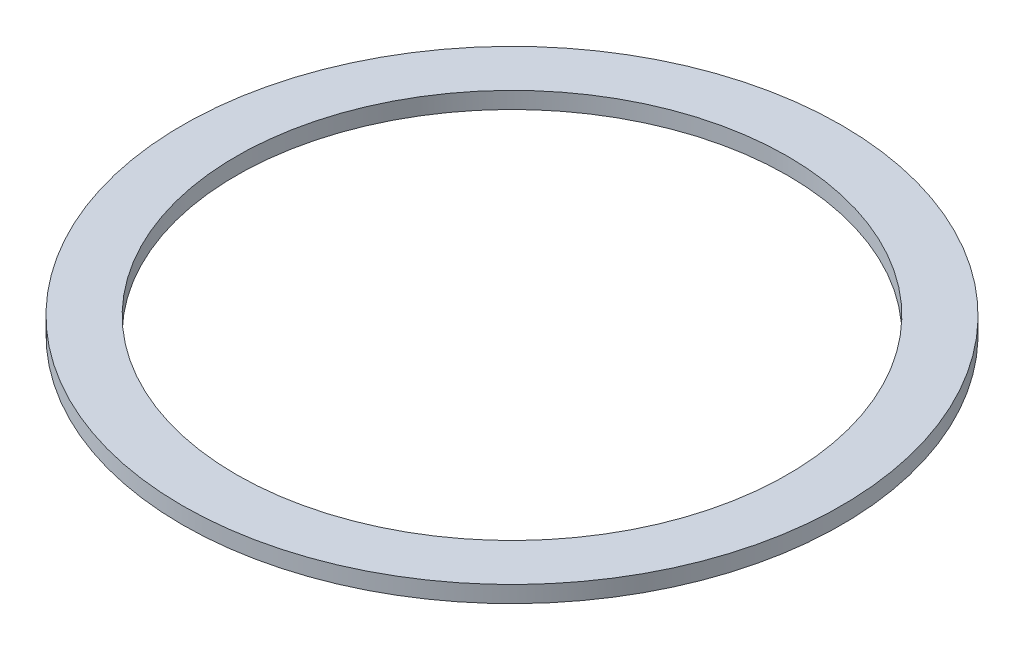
from build123d import *

# Parameters (mm, degrees)
SKETCH1_W = 26
SKETCH1_H = 8


with BuildPart() as part:
    # Sketch1 → Steel Ballast Ring (revolve)
    with BuildSketch(Plane.XY, mode=Mode.PRIVATE) as steel_ballast_ring_sk:
        with Locations((146, 4)):
            Rectangle(SKETCH1_W, SKETCH1_H)
    revolve(steel_ballast_ring_sk.sketch.rotate(Axis((0, -10, 0), (0, 1, 0)), 90), axis=Axis((0, -10, 0), (0, 1, 0)))


solid = part.part
